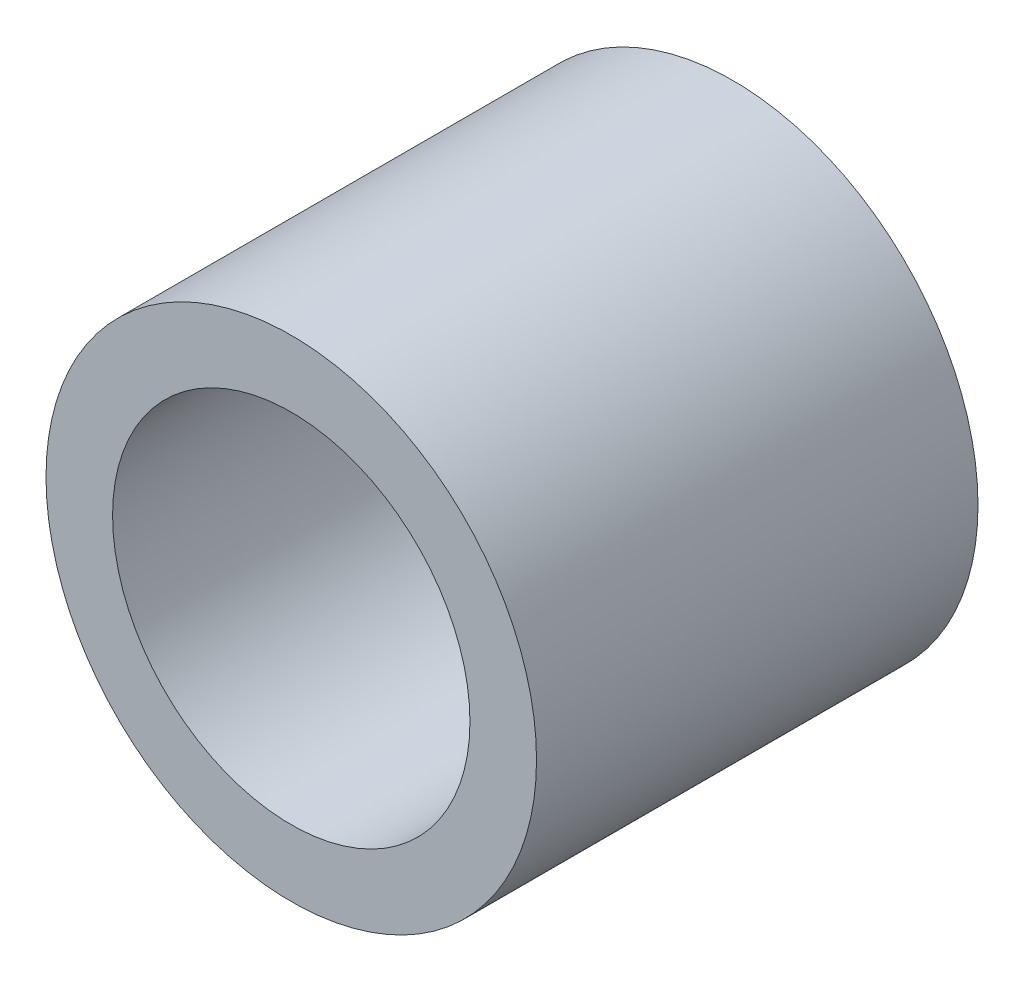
from build123d import *

# Parameters (mm, degrees)
ESQUISSE1_R      = 17.5
ESQUISSE1_R_2    = 12.75
EXTRUSION1_DEPTH = 15.75


with BuildPart() as part:
    # Esquisse1 → Extrusion1 (new, symmetric)
    with BuildSketch(Plane.XY):
        Circle(ESQUISSE1_R)
        Circle(ESQUISSE1_R_2, mode=Mode.SUBTRACT)
    extrude(amount=EXTRUSION1_DEPTH, both=True)


solid = part.part
